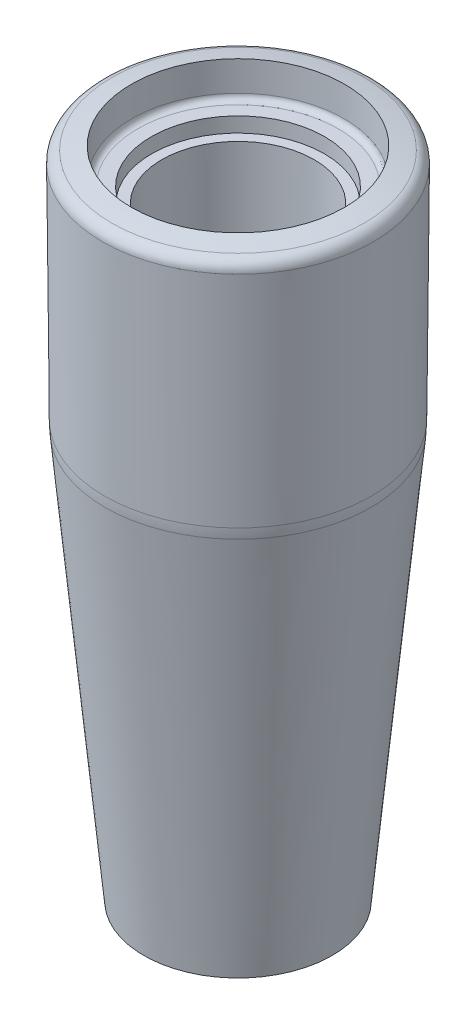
ISO-10303-21;
HEADER;
FILE_DESCRIPTION(('STEP AP214'),'2;1');
FILE_NAME('part.step','',(''),(''),'','','');
FILE_SCHEMA(('AUTOMOTIVE_DESIGN { 1 0 10303 214 1 1 1 1 }'));
ENDSEC;
DATA;
#1=APPLICATION_CONTEXT('core data for automotive mechanical design processes');
#2=APPLICATION_PROTOCOL_DEFINITION('international standard','automotive_design',2000,#1);
#3=PRODUCT_CONTEXT('',#1,'mechanical');
#4=PRODUCT('Part','Part','',(#3));
#5=PRODUCT_RELATED_PRODUCT_CATEGORY('part','',(#4));
#6=PRODUCT_DEFINITION_FORMATION('','',#4);
#7=PRODUCT_DEFINITION_CONTEXT('part definition',#1,'design');
#8=PRODUCT_DEFINITION('design','',#6,#7);
#9=PRODUCT_DEFINITION_SHAPE('','',#8);
#10=(LENGTH_UNIT() NAMED_UNIT(*) SI_UNIT(.MILLI.,.METRE.));
#11=(NAMED_UNIT(*) PLANE_ANGLE_UNIT() SI_UNIT($,.RADIAN.));
#12=(NAMED_UNIT(*) SI_UNIT($,.STERADIAN.) SOLID_ANGLE_UNIT());
#13=UNCERTAINTY_MEASURE_WITH_UNIT(LENGTH_MEASURE(1.E-05),#10,'distance_accuracy_value','');
#14=(GEOMETRIC_REPRESENTATION_CONTEXT(3) GLOBAL_UNCERTAINTY_ASSIGNED_CONTEXT((#13)) GLOBAL_UNIT_ASSIGNED_CONTEXT((#10,
#11,#12)) REPRESENTATION_CONTEXT('',''));
#15=CARTESIAN_POINT('',(0.,0.,0.));
#16=DIRECTION('',(0.,0.,1.));
#17=DIRECTION('',(1.,0.,0.));
#18=AXIS2_PLACEMENT_3D('',#15,#16,#17);
#19=CARTESIAN_POINT('',(2.22044604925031E-13,0.,1.11022302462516E-13));
#20=DIRECTION('',(0.,-1.00000000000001,0.));
#21=DIRECTION('',(0.,0.,-1.));
#22=AXIS2_PLACEMENT_3D('',#19,#20,#21);
#23=PLANE('',#22);
#24=CARTESIAN_POINT('',(2.22044604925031E-13,0.,1.11022302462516E-13));
#25=DIRECTION('',(0.,-1.00000000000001,0.));
#26=DIRECTION('',(0.,0.,-1.));
#27=AXIS2_PLACEMENT_3D('',#24,#25,#26);
#28=CIRCLE('',#27,4.62500000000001);
#29=CARTESIAN_POINT('',(2.28623543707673E-13,0.,-4.62499999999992));
#30=VERTEX_POINT('',#29);
#31=EDGE_CURVE('E49',#30,#30,#28,.F.);
#32=ORIENTED_EDGE('',*,*,#31,.T.);
#33=EDGE_LOOP('',(#32));
#34=FACE_BOUND('',#33,.T.);
#35=CARTESIAN_POINT('',(2.22044604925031E-13,0.,1.11022302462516E-13));
#36=DIRECTION('',(0.,-1.00000000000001,0.));
#37=DIRECTION('',(0.,0.,-1.));
#38=AXIS2_PLACEMENT_3D('',#35,#36,#37);
#39=CIRCLE('',#38,8.);
#40=CARTESIAN_POINT('',(2.33424390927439E-13,0.,-7.99999999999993));
#41=VERTEX_POINT('',#40);
#42=EDGE_CURVE('E71',#41,#41,#39,.T.);
#43=ORIENTED_EDGE('',*,*,#42,.T.);
#44=EDGE_LOOP('',(#43));
#45=FACE_BOUND('',#44,.T.);
#46=ADVANCED_FACE('F30',(#34,#45),#23,.T.);
#47=CARTESIAN_POINT('',(2.22044604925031E-13,0.,1.11022302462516E-13));
#48=DIRECTION('',(0.,1.00000000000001,0.));
#49=DIRECTION('',(0.,0.,1.));
#50=AXIS2_PLACEMENT_3D('',#47,#48,#49);
#51=CONICAL_SURFACE('',#50,8.,0.0947288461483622);
#52=CARTESIAN_POINT('',(-3.33066907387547E-13,34.5716528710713,-3.33066907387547E-13));
#53=DIRECTION('',(0.,-1.00000000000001,0.));
#54=DIRECTION('',(0.,0.,-1.));
#55=AXIS2_PLACEMENT_3D('',#52,#53,#54);
#56=CIRCLE('',#55,11.2847640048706);
#57=CARTESIAN_POINT('',(-3.17014632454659E-13,34.5716528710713,-11.284764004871));
#58=VERTEX_POINT('',#57);
#59=EDGE_CURVE('E68',#58,#58,#56,.T.);
#60=ORIENTED_EDGE('',*,*,#59,.T.);
#61=EDGE_LOOP('',(#60));
#62=FACE_BOUND('',#61,.T.);
#63=ORIENTED_EDGE('',*,*,#42,.F.);
#64=EDGE_LOOP('',(#63));
#65=FACE_BOUND('',#64,.T.);
#66=ADVANCED_FACE('F105',(#62,#65),#51,.T.);
#67=CARTESIAN_POINT('',(-2.77555756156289E-13,35.0000000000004,-4.44089209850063E-13));
#68=DIRECTION('',(0.,1.00000000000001,0.));
#69=DIRECTION('',(0.,0.,1.));
#70=AXIS2_PLACEMENT_3D('',#67,#68,#69);
#71=CONICAL_SURFACE('',#70,11.3254626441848,0.00872664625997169);
#72=CARTESIAN_POINT('',(1.38777878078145E-13,54.1950543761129,-2.22044604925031E-13));
#73=DIRECTION('',(0.,-1.00000000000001,0.));
#74=DIRECTION('',(0.,0.,-1.));
#75=AXIS2_PLACEMENT_3D('',#72,#73,#74);
#76=CIRCLE('',#75,11.4929753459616);
#77=CARTESIAN_POINT('',(1.55126328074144E-13,54.1950543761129,-11.4929753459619));
#78=VERTEX_POINT('',#77);
#79=EDGE_CURVE('E62',#78,#78,#76,.T.);
#80=ORIENTED_EDGE('',*,*,#79,.T.);
#81=EDGE_LOOP('',(#80));
#82=FACE_BOUND('',#81,.T.);
#83=CARTESIAN_POINT('',(-1.94289029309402E-13,35.4302598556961,-4.44089209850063E-13));
#84=DIRECTION('',(0.,-1.00000000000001,0.));
#85=DIRECTION('',(0.,0.,-1.));
#86=AXIS2_PLACEMENT_3D('',#83,#84,#85);
#87=CIRCLE('',#86,11.3292174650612);
#88=CARTESIAN_POINT('',(-1.7817352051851E-13,35.4302598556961,-11.3292174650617));
#89=VERTEX_POINT('',#88);
#90=EDGE_CURVE('E65',#89,#89,#87,.F.);
#91=ORIENTED_EDGE('',*,*,#90,.T.);
#92=EDGE_LOOP('',(#91));
#93=FACE_BOUND('',#92,.T.);
#94=ADVANCED_FACE('F110',(#82,#93),#71,.T.);
#95=CARTESIAN_POINT('',(-3.05311331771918E-13,6.34046855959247,-3.33066907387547E-13));
#96=DIRECTION('',(0.,-1.00000000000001,0.));
#97=DIRECTION('',(1.00000000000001,0.,0.));
#98=AXIS2_PLACEMENT_3D('',#95,#96,#97);
#99=SPHERICAL_SURFACE('',#98,50.);
#100=CARTESIAN_POINT('',(0.,55.1805832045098,1.11022302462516E-13));
#101=DIRECTION('',(0.,-1.00000000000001,0.));
#102=DIRECTION('',(0.,0.,-1.));
#103=AXIS2_PLACEMENT_3D('',#100,#101,#102);
#104=CIRCLE('',#103,10.7071565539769);
#105=CARTESIAN_POINT('',(10.7071565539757,55.1805832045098,-3.03138221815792E-13));
#106=VERTEX_POINT('',#105);
#107=EDGE_CURVE('E55',#106,#106,#104,.F.);
#108=CARTESIAN_POINT('',(0.,55.514188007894,-1.11022302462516E-13));
#109=DIRECTION('',(0.,-1.00000000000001,0.));
#110=DIRECTION('',(0.,0.,-1.));
#111=AXIS2_PLACEMENT_3D('',#108,#109,#110);
#112=CIRCLE('',#111,9.05236519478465);
#113=CARTESIAN_POINT('',(9.05236519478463,55.514188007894,-2.99013094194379E-13));
#114=VERTEX_POINT('',#113);
#115=EDGE_CURVE('E74',#114,#114,#112,.T.);
#116=CARTESIAN_POINT('',(10.7071565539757,55.1805832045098,-3.03138221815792E-13));
#117=CARTESIAN_POINT('',(10.6899794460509,55.184348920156,-3.03095065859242E-13));
#118=CARTESIAN_POINT('',(10.6728003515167,55.1881055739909,-3.03051915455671E-13));
#119=CARTESIAN_POINT('',(10.6384382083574,55.195600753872,-3.02965625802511E-13));
#120=CARTESIAN_POINT('',(10.6212551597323,55.1993392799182,-3.02922486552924E-13));
#121=CARTESIAN_POINT('',(10.5868851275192,55.2067982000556,-3.02836219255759E-13));
#122=CARTESIAN_POINT('',(10.5696981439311,55.2105185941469,-3.02793091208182E-13));
#123=CARTESIAN_POINT('',(10.5353202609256,55.217941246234,-3.0270684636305E-13));
#124=CARTESIAN_POINT('',(10.5181293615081,55.2216435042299,-3.02663729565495E-13));
#125=CARTESIAN_POINT('',(10.4837436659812,55.2290298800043,-3.02577507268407E-13));
#126=CARTESIAN_POINT('',(10.4665488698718,55.2327139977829,-3.02534401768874E-13));
#127=CARTESIAN_POINT('',(10.432155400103,55.2400640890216,-3.02448202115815E-13));
#128=CARTESIAN_POINT('',(10.4149567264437,55.2437300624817,-3.0240510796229E-13));
#129=CARTESIAN_POINT('',(10.3805555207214,55.2510438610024,-3.02318931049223E-13));
#130=CARTESIAN_POINT('',(10.3633529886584,55.2546916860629,-3.02275848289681E-13));
#131=CARTESIAN_POINT('',(10.3289440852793,55.2619691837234,-3.0218969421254E-13));
#132=CARTESIAN_POINT('',(10.3117377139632,55.2655988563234,-3.02146622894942E-13));
#133=CARTESIAN_POINT('',(10.2773211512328,55.2728400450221,-3.02060491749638E-13));
#134=CARTESIAN_POINT('',(10.2601109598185,55.2764515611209,-3.02017431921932E-13));
#135=CARTESIAN_POINT('',(10.2256867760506,55.2836564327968,-3.0193132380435E-13));
#136=CARTESIAN_POINT('',(10.2084727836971,55.2872497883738,-3.01888275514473E-13));
#137=CARTESIAN_POINT('',(10.1740410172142,55.294418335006,-3.01802190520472E-13));
#138=CARTESIAN_POINT('',(10.1568232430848,55.2979935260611,-3.01759153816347E-13));
#139=CARTESIAN_POINT('',(10.1223839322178,55.3051257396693,-3.01673092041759E-13));
#140=CARTESIAN_POINT('',(10.1051623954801,55.3086827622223,-3.01630066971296E-13));
#141=CARTESIAN_POINT('',(10.0707155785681,55.3157786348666,-3.0154402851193E-13));
#142=CARTESIAN_POINT('',(10.0534902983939,55.3193174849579,-3.01501015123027E-13));
#143=CARTESIAN_POINT('',(10.0190360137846,55.3263770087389,-3.01415000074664E-13));
#144=CARTESIAN_POINT('',(10.0018070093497,55.3298976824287,-3.01371998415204E-13));
#145=CARTESIAN_POINT('',(9.96734529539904,55.3369208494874,-3.012860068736E-13));
#146=CARTESIAN_POINT('',(9.95011258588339,55.3404233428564,-3.01243016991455E-13));
#147=CARTESIAN_POINT('',(9.9156434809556,55.3474101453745,-3.01157049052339E-13));
#148=CARTESIAN_POINT('',(9.89840708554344,55.3508944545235,-3.01114070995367E-13));
#149=CARTESIAN_POINT('',(9.8639306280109,55.3578448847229,-3.01028126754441E-13));
#150=CARTESIAN_POINT('',(9.8466905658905,55.3613110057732,-3.00985160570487E-13));
#151=CARTESIAN_POINT('',(9.81220679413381,55.3682250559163,-3.00899240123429E-13));
#152=CARTESIAN_POINT('',(9.79496308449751,55.3716729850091,-3.00856285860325E-13));
#153=CARTESIAN_POINT('',(9.76047203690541,55.378550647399,-3.00770389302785E-13));
#154=CARTESIAN_POINT('',(9.74322469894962,55.3819803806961,-3.00727447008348E-13));
#155=CARTESIAN_POINT('',(9.70872641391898,55.3888216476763,-3.00641574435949E-13));
#156=CARTESIAN_POINT('',(9.69147546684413,55.3922331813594,-3.00598644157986E-13));
#157=CARTESIAN_POINT('',(9.65696998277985,55.3990380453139,-3.00512795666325E-13));
#158=CARTESIAN_POINT('',(9.63971544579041,55.4024313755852,-3.00469877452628E-13));
#159=CARTESIAN_POINT('',(9.60520280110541,55.4091998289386,-3.00384053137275E-13));
#160=CARTESIAN_POINT('',(9.58794469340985,55.4125749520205,-3.0034114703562E-13));
#161=CARTESIAN_POINT('',(9.55342492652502,55.4193069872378,-3.00255346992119E-13));
#162=CARTESIAN_POINT('',(9.53616326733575,55.4226638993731,-3.00212453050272E-13));
#163=CARTESIAN_POINT('',(9.50163641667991,55.4293595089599,-3.00126677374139E-13));
#164=CARTESIAN_POINT('',(9.48437122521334,55.4326982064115,-3.00083795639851E-13));
#165=CARTESIAN_POINT('',(9.44983732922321,55.439357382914,-2.99998044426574E-13));
#166=CARTESIAN_POINT('',(9.43256862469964,55.442677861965,-2.99955174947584E-13));
#167=CARTESIAN_POINT('',(9.39802772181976,55.44930059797,-2.99869448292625E-13));
#168=CARTESIAN_POINT('',(9.38075552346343,55.452602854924,-2.99826591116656E-13));
#169=CARTESIAN_POINT('',(9.34620765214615,55.4591891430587,-2.9974088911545E-13));
#170=CARTESIAN_POINT('',(9.32893197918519,55.4624731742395,-2.99698044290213E-13));
#171=CARTESIAN_POINT('',(9.29437717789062,55.4690230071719,-2.99612367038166E-13));
#172=CARTESIAN_POINT('',(9.27709804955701,55.4722888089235,-2.99569534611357E-13));
#173=CARTESIAN_POINT('',(9.24253635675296,55.4788021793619,-2.9948388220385E-13));
#174=CARTESIAN_POINT('',(9.22525379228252,55.4820497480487,-2.99441062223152E-13));
#175=CARTESIAN_POINT('',(9.19068524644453,55.4885266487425,-2.99355434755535E-13));
#176=CARTESIAN_POINT('',(9.17339926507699,55.4917559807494,-2.99312627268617E-13));
#177=CARTESIAN_POINT('',(9.13882390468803,55.4981964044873,-2.99227024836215E-13));
#178=CARTESIAN_POINT('',(9.12153452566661,55.5014074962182,-2.99184229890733E-13));
#179=CARTESIAN_POINT('',(9.08695238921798,55.5078114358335,-2.99098652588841E-13));
#180=CARTESIAN_POINT('',(9.06965963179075,55.511004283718,-2.99055870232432E-13));
#181=CARTESIAN_POINT('',(9.05236519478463,55.514188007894,-2.99013094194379E-13));
#182=B_SPLINE_CURVE_WITH_KNOTS('',3,(#116,#117,#118,#119,#120,#121,#122,#123,#124,#125,#126,
#127,#128,#129,#130,#131,#132,#133,#134,#135,#136,#137,#138,#139,#140,#141,#142,#143,#144,#145,
#146,#147,#148,#149,#150,#151,#152,#153,#154,#155,#156,#157,#158,#159,#160,#161,#162,#163,#164,
#165,#166,#167,#168,#169,#170,#171,#172,#173,#174,#175,#176,#177,#178,#179,#180,#181),
.UNSPECIFIED.,.F.,.F.,(4,2,2,2,2,2,2,2,2,2,2,2,2,2,2,2,2,2,2,2,2,2,2,2,2,2,2,2,2,2,2,2,4),(0.,
0.0527551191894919,0.105510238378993,0.158265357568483,0.211020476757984,0.263775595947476,
0.316530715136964,0.369285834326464,0.422040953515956,0.474796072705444,0.527551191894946,
0.580306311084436,0.633061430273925,0.685816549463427,0.738571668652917,0.791326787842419,
0.84408190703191,0.896837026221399,0.949592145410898,1.00234726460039,1.05510238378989,
1.10785750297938,1.16061262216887,1.21336774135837,1.26612286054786,1.31887797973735,
1.37163309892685,1.42438821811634,1.47714333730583,1.52989845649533,1.58265357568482,
1.63540869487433,1.68816381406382),.UNSPECIFIED.);
#183=EDGE_CURVE('BSEAM147',#106,#114,#182,.T.);
#184=ORIENTED_EDGE('',*,*,#107,.T.);
#185=ORIENTED_EDGE('',*,*,#115,.T.);
#186=ORIENTED_EDGE('',*,*,#183,.T.);
#187=ORIENTED_EDGE('',*,*,#183,.F.);
#188=EDGE_LOOP('',(#184,#186,#185,#187));
#189=FACE_BOUND('',#188,.T.);
#190=ADVANCED_FACE('F147',(#189),#99,.T.);
#191=CARTESIAN_POINT('',(0.,55.514188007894,-1.11022302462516E-13));
#192=DIRECTION('',(0.,1.00000000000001,0.));
#193=DIRECTION('',(0.,0.,1.));
#194=AXIS2_PLACEMENT_3D('',#191,#192,#193);
#195=CONICAL_SURFACE('',#194,9.05236519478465,0.0174532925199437);
#196=CARTESIAN_POINT('',(-1.66533453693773E-13,53.0054618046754,-3.33066907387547E-13));
#197=DIRECTION('',(0.,1.00000000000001,0.));
#198=DIRECTION('',(0.,0.,1.));
#199=AXIS2_PLACEMENT_3D('',#196,#197,#198);
#200=CIRCLE('',#199,9.00857521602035);
#201=CARTESIAN_POINT('',(-1.79347910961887E-13,53.0054618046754,9.00857521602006));
#202=VERTEX_POINT('',#201);
#203=EDGE_CURVE('E44',#202,#202,#200,.F.);
#204=ORIENTED_EDGE('',*,*,#203,.T.);
#205=EDGE_LOOP('',(#204));
#206=FACE_BOUND('',#205,.T.);
#207=ORIENTED_EDGE('',*,*,#115,.F.);
#208=EDGE_LOOP('',(#207));
#209=FACE_BOUND('',#208,.T.);
#210=ADVANCED_FACE('F153',(#206,#209),#195,.F.);
#211=CARTESIAN_POINT('',(7.35000000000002,52.5141880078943,-3.33066907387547E-13));
#212=DIRECTION('',(0.,1.00000000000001,0.));
#213=DIRECTION('',(0.,0.,1.));
#214=AXIS2_PLACEMENT_3D('',#211,#212,#213);
#215=PLANE('',#214);
#216=CARTESIAN_POINT('',(0.,52.5141880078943,-1.11022302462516E-13));
#217=DIRECTION('',(0.,1.00000000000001,0.));
#218=DIRECTION('',(0.,0.,1.));
#219=AXIS2_PLACEMENT_3D('',#216,#217,#218);
#220=CIRCLE('',#219,8.50865136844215);
#221=CARTESIAN_POINT('',(0.,52.5141880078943,8.50865136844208));
#222=VERTEX_POINT('',#221);
#223=EDGE_CURVE('E40',#222,#222,#220,.T.);
#224=ORIENTED_EDGE('',*,*,#223,.T.);
#225=EDGE_LOOP('',(#224));
#226=FACE_BOUND('',#225,.T.);
#227=CARTESIAN_POINT('',(0.,52.5141880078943,-1.11022302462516E-13));
#228=DIRECTION('',(0.,-1.00000000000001,0.));
#229=DIRECTION('',(0.,0.,-1.));
#230=AXIS2_PLACEMENT_3D('',#227,#228,#229);
#231=CIRCLE('',#230,7.35);
#232=CARTESIAN_POINT('',(0.,52.5141880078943,-7.35000000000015));
#233=VERTEX_POINT('',#232);
#234=EDGE_CURVE('E77',#233,#233,#231,.T.);
#235=ORIENTED_EDGE('',*,*,#234,.T.);
#236=EDGE_LOOP('',(#235));
#237=FACE_BOUND('',#236,.T.);
#238=ADVANCED_FACE('F159',(#226,#237),#215,.T.);
#239=CARTESIAN_POINT('',(0.,52.5141880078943,-1.11022302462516E-13));
#240=DIRECTION('',(0.,1.00000000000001,0.));
#241=DIRECTION('',(0.,0.,1.));
#242=AXIS2_PLACEMENT_3D('',#239,#240,#241);
#243=CONICAL_SURFACE('',#242,7.35,0.017453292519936);
#244=CARTESIAN_POINT('',(-3.60822483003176E-13,51.2641880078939,-4.44089209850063E-13));
#245=DIRECTION('',(0.,-1.00000000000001,0.));
#246=DIRECTION('',(0.,0.,-1.));
#247=AXIS2_PLACEMENT_3D('',#244,#245,#246);
#248=CIRCLE('',#247,7.32818116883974);
#249=CARTESIAN_POINT('',(-3.50398341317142E-13,51.2641880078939,-7.32818116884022));
#250=VERTEX_POINT('',#249);
#251=EDGE_CURVE('E80',#250,#250,#248,.T.);
#252=ORIENTED_EDGE('',*,*,#251,.T.);
#253=EDGE_LOOP('',(#252));
#254=FACE_BOUND('',#253,.T.);
#255=ORIENTED_EDGE('',*,*,#234,.F.);
#256=EDGE_LOOP('',(#255));
#257=FACE_BOUND('',#256,.T.);
#258=ADVANCED_FACE('F163',(#254,#257),#243,.F.);
#259=CARTESIAN_POINT('',(7.32818116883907,51.2641880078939,-4.44089209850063E-13));
#260=DIRECTION('',(0.,1.00000000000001,0.));
#261=DIRECTION('',(0.,0.,1.));
#262=AXIS2_PLACEMENT_3D('',#259,#260,#261);
#263=PLANE('',#262);
#264=CARTESIAN_POINT('',(-3.60822483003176E-13,51.2641880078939,-4.44089209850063E-13));
#265=DIRECTION('',(0.,-1.00000000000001,0.));
#266=DIRECTION('',(0.,0.,-1.));
#267=AXIS2_PLACEMENT_3D('',#264,#265,#266);
#268=CIRCLE('',#267,6.46720767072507);
#269=CARTESIAN_POINT('',(-3.51623053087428E-13,51.2641880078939,-6.46720767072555));
#270=VERTEX_POINT('',#269);
#271=EDGE_CURVE('E83',#270,#270,#268,.T.);
#272=ORIENTED_EDGE('',*,*,#271,.T.);
#273=EDGE_LOOP('',(#272));
#274=FACE_BOUND('',#273,.T.);
#275=ORIENTED_EDGE('',*,*,#251,.F.);
#276=EDGE_LOOP('',(#275));
#277=FACE_BOUND('',#276,.T.);
#278=ADVANCED_FACE('F102',(#274,#277),#263,.T.);
#279=CARTESIAN_POINT('',(-3.60822483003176E-13,51.2641880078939,-4.44089209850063E-13));
#280=DIRECTION('',(0.,1.00000000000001,0.));
#281=DIRECTION('',(0.,0.,1.));
#282=AXIS2_PLACEMENT_3D('',#279,#280,#281);
#283=CONICAL_SURFACE('',#282,6.46720767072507,0.00872664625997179);
#284=CARTESIAN_POINT('',(-2.77555756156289E-13,35.2587626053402,-7.7715611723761E-13));
#285=DIRECTION('',(0.,-1.00000000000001,0.));
#286=DIRECTION('',(0.,0.,-1.));
#287=AXIS2_PLACEMENT_3D('',#284,#285,#286);
#288=CIRCLE('',#287,6.32753043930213);
#289=CARTESIAN_POINT('',(-2.68555013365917E-13,35.2587626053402,-6.32753043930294));
#290=VERTEX_POINT('',#289);
#291=EDGE_CURVE('E59',#290,#290,#288,.T.);
#292=ORIENTED_EDGE('',*,*,#291,.T.);
#293=EDGE_LOOP('',(#292));
#294=FACE_BOUND('',#293,.T.);
#295=ORIENTED_EDGE('',*,*,#271,.F.);
#296=EDGE_LOOP('',(#295));
#297=FACE_BOUND('',#296,.T.);
#298=ADVANCED_FACE('F89',(#294,#297),#283,.F.);
#299=CARTESIAN_POINT('',(-2.77555756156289E-13,35.2587626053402,-7.7715611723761E-13));
#300=DIRECTION('',(0.,1.00000000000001,0.));
#301=DIRECTION('',(0.,0.,1.));
#302=AXIS2_PLACEMENT_3D('',#299,#300,#301);
#303=CONICAL_SURFACE('',#302,6.32753043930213,0.0947288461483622);
#304=CARTESIAN_POINT('',(-3.33066907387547E-13,12.4527063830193,-7.7715611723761E-13));
#305=DIRECTION('',(0.,1.00000000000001,0.));
#306=DIRECTION('',(0.,0.,1.));
#307=AXIS2_PLACEMENT_3D('',#304,#305,#306);
#308=CIRCLE('',#307,4.16065363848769);
#309=CARTESIAN_POINT('',(-3.38985325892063E-13,12.4527063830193,4.16065363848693));
#310=VERTEX_POINT('',#309);
#311=EDGE_CURVE('E36',#310,#310,#308,.F.);
#312=ORIENTED_EDGE('',*,*,#311,.T.);
#313=EDGE_LOOP('',(#312));
#314=FACE_BOUND('',#313,.T.);
#315=ORIENTED_EDGE('',*,*,#291,.F.);
#316=EDGE_LOOP('',(#315));
#317=FACE_BOUND('',#316,.T.);
#318=ADVANCED_FACE('F92',(#314,#317),#303,.F.);
#319=CARTESIAN_POINT('',(-3.88578058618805E-13,11.9999999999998,-5.55111512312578E-13));
#320=DIRECTION('',(0.,1.00000000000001,0.));
#321=DIRECTION('',(0.,0.,1.));
#322=AXIS2_PLACEMENT_3D('',#319,#320,#321);
#323=PLANE('',#322);
#324=CARTESIAN_POINT('',(-3.88578058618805E-13,11.9999999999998,-5.55111512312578E-13));
#325=DIRECTION('',(0.,1.00000000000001,0.));
#326=DIRECTION('',(0.,0.,1.));
#327=AXIS2_PLACEMENT_3D('',#324,#325,#326);
#328=CIRCLE('',#327,3.66289534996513);
#329=CARTESIAN_POINT('',(-3.93788429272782E-13,11.9999999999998,3.66289534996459));
#330=VERTEX_POINT('',#329);
#331=EDGE_CURVE('E10',#330,#330,#328,.T.);
#332=ORIENTED_EDGE('',*,*,#331,.T.);
#333=EDGE_LOOP('',(#332));
#334=FACE_BOUND('',#333,.T.);
#335=CARTESIAN_POINT('',(-3.88578058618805E-13,11.9999999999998,-5.55111512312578E-13));
#336=DIRECTION('',(0.,1.00000000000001,0.));
#337=DIRECTION('',(0.,0.,1.));
#338=AXIS2_PLACEMENT_3D('',#335,#336,#337);
#339=CIRCLE('',#338,3.375);
#340=CARTESIAN_POINT('',(-3.93378905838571E-13,11.9999999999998,3.37499999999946));
#341=VERTEX_POINT('',#340);
#342=EDGE_CURVE('E56',#341,#341,#339,.T.);
#343=ORIENTED_EDGE('',*,*,#342,.F.);
#344=EDGE_LOOP('',(#343));
#345=FACE_BOUND('',#344,.T.);
#346=ADVANCED_FACE('F94',(#334,#345),#323,.T.);
#347=CARTESIAN_POINT('',(-5.55111512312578E-13,35.5175252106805,-4.44089209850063E-13));
#348=DIRECTION('',(0.,1.00000000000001,0.));
#349=DIRECTION('',(0.,0.,1.));
#350=AXIS2_PLACEMENT_3D('',#347,#348,#349);
#351=DEGENERATE_TOROIDAL_SURFACE('',#350,1.32959823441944,10.,.T.);
#352=ORIENTED_EDGE('',*,*,#90,.F.);
#353=EDGE_LOOP('',(#352));
#354=FACE_BOUND('',#353,.T.);
#355=ORIENTED_EDGE('',*,*,#59,.F.);
#356=EDGE_LOOP('',(#355));
#357=FACE_BOUND('',#356,.T.);
#358=ADVANCED_FACE('F100',(#354,#357),#351,.T.);
#359=CARTESIAN_POINT('',(-4.71844785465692E-13,54.2037809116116,-7.7715611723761E-13));
#360=DIRECTION('',(0.,-1.00000000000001,0.));
#361=DIRECTION('',(0.,0.,-1.));
#362=AXIS2_PLACEMENT_3D('',#359,#360,#361);
#363=TOROIDAL_SURFACE('',#362,10.4930134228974,1.);
#364=ORIENTED_EDGE('',*,*,#107,.F.);
#365=EDGE_LOOP('',(#364));
#366=FACE_BOUND('',#365,.T.);
#367=ORIENTED_EDGE('',*,*,#79,.F.);
#368=EDGE_LOOP('',(#367));
#369=FACE_BOUND('',#368,.T.);
#370=ADVANCED_FACE('F127',(#366,#369),#363,.T.);
#371=CARTESIAN_POINT('',(0.,55.514188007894,-1.11022302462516E-13));
#372=DIRECTION('',(0.,-1.00000000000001,0.));
#373=DIRECTION('',(0.,0.,-1.));
#374=AXIS2_PLACEMENT_3D('',#371,#372,#373);
#375=CYLINDRICAL_SURFACE('',#374,3.375);
#376=CARTESIAN_POINT('',(1.11022302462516E-13,1.24999999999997,0.));
#377=DIRECTION('',(0.,-1.00000000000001,0.));
#378=DIRECTION('',(0.,0.,-1.));
#379=AXIS2_PLACEMENT_3D('',#376,#377,#378);
#380=CIRCLE('',#379,3.375);
#381=CARTESIAN_POINT('',(1.15823149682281E-13,1.24999999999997,-3.37500000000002));
#382=VERTEX_POINT('',#381);
#383=EDGE_CURVE('E52',#382,#382,#380,.T.);
#384=ORIENTED_EDGE('',*,*,#383,.T.);
#385=EDGE_LOOP('',(#384));
#386=FACE_BOUND('',#385,.T.);
#387=ORIENTED_EDGE('',*,*,#342,.T.);
#388=EDGE_LOOP('',(#387));
#389=FACE_BOUND('',#388,.T.);
#390=ADVANCED_FACE('F121',(#386,#389),#375,.F.);
#391=CARTESIAN_POINT('',(1.11022302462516E-13,1.24999999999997,0.));
#392=DIRECTION('',(0.,-1.00000000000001,0.));
#393=DIRECTION('',(0.,0.,-1.));
#394=AXIS2_PLACEMENT_3D('',#391,#392,#393);
#395=CONICAL_SURFACE('',#394,3.375,0.78539816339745);
#396=ORIENTED_EDGE('',*,*,#31,.F.);
#397=EDGE_LOOP('',(#396));
#398=FACE_BOUND('',#397,.T.);
#399=ORIENTED_EDGE('',*,*,#383,.F.);
#400=EDGE_LOOP('',(#399));
#401=FACE_BOUND('',#400,.T.);
#402=ADVANCED_FACE('F117',(#398,#401),#395,.F.);
#403=CARTESIAN_POINT('',(-3.33066907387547E-13,53.0141880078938,-2.22044604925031E-13));
#404=DIRECTION('',(0.,1.00000000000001,0.));
#405=DIRECTION('',(0.,0.,1.));
#406=AXIS2_PLACEMENT_3D('',#403,#404,#405);
#407=TOROIDAL_SURFACE('',#406,8.50865136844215,0.5);
#408=ORIENTED_EDGE('',*,*,#223,.F.);
#409=EDGE_LOOP('',(#408));
#410=FACE_BOUND('',#409,.T.);
#411=ORIENTED_EDGE('',*,*,#203,.F.);
#412=EDGE_LOOP('',(#411));
#413=FACE_BOUND('',#412,.T.);
#414=ADVANCED_FACE('F120',(#410,#413),#407,.F.);
#415=CARTESIAN_POINT('',(-1.94289029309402E-13,12.5000000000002,-4.44089209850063E-13));
#416=DIRECTION('',(0.,1.00000000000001,0.));
#417=DIRECTION('',(0.,0.,1.));
#418=AXIS2_PLACEMENT_3D('',#415,#416,#417);
#419=TOROIDAL_SURFACE('',#418,3.66289534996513,0.5);
#420=ORIENTED_EDGE('',*,*,#331,.F.);
#421=EDGE_LOOP('',(#420));
#422=FACE_BOUND('',#421,.T.);
#423=ORIENTED_EDGE('',*,*,#311,.F.);
#424=EDGE_LOOP('',(#423));
#425=FACE_BOUND('',#424,.T.);
#426=ADVANCED_FACE('F223',(#422,#425),#419,.F.);
#427=CLOSED_SHELL('',(#46,#66,#94,#190,#210,#238,#258,#278,#298,#318,#346,#358,#370,#390,#402,
#414,#426));
#428=MANIFOLD_SOLID_BREP('B2',#427);
#429=ADVANCED_BREP_SHAPE_REPRESENTATION('',(#18,#428),#14);
#430=SHAPE_DEFINITION_REPRESENTATION(#9,#429);
ENDSEC;
END-ISO-10303-21;
